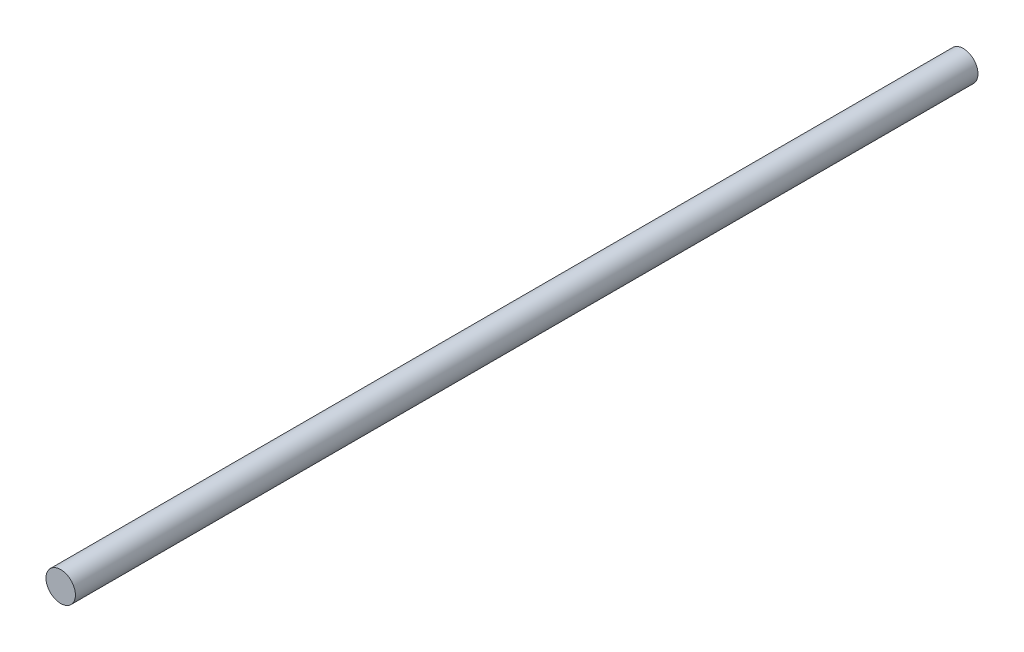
ISO-10303-21;
HEADER;
FILE_DESCRIPTION(('STEP AP214'),'2;1');
FILE_NAME('part.step','',(''),(''),'','','');
FILE_SCHEMA(('AUTOMOTIVE_DESIGN { 1 0 10303 214 1 1 1 1 }'));
ENDSEC;
DATA;
#1=APPLICATION_CONTEXT('core data for automotive mechanical design processes');
#2=APPLICATION_PROTOCOL_DEFINITION('international standard','automotive_design',2000,#1);
#3=PRODUCT_CONTEXT('',#1,'mechanical');
#4=PRODUCT('Part','Part','',(#3));
#5=PRODUCT_RELATED_PRODUCT_CATEGORY('part','',(#4));
#6=PRODUCT_DEFINITION_FORMATION('','',#4);
#7=PRODUCT_DEFINITION_CONTEXT('part definition',#1,'design');
#8=PRODUCT_DEFINITION('design','',#6,#7);
#9=PRODUCT_DEFINITION_SHAPE('','',#8);
#10=(LENGTH_UNIT() NAMED_UNIT(*) SI_UNIT(.MILLI.,.METRE.));
#11=(NAMED_UNIT(*) PLANE_ANGLE_UNIT() SI_UNIT($,.RADIAN.));
#12=(NAMED_UNIT(*) SI_UNIT($,.STERADIAN.) SOLID_ANGLE_UNIT());
#13=UNCERTAINTY_MEASURE_WITH_UNIT(LENGTH_MEASURE(1.E-05),#10,'distance_accuracy_value','');
#14=(GEOMETRIC_REPRESENTATION_CONTEXT(3) GLOBAL_UNCERTAINTY_ASSIGNED_CONTEXT((#13)) GLOBAL_UNIT_ASSIGNED_CONTEXT((#10,
#11,#12)) REPRESENTATION_CONTEXT('',''));
#15=CARTESIAN_POINT('',(0.,0.,0.));
#16=DIRECTION('',(0.,0.,1.));
#17=DIRECTION('',(1.,0.,0.));
#18=AXIS2_PLACEMENT_3D('',#15,#16,#17);
#19=CARTESIAN_POINT('',(0.,0.,171.73));
#20=DIRECTION('',(0.,0.,-1.));
#21=DIRECTION('',(-1.,0.,0.));
#22=AXIS2_PLACEMENT_3D('',#19,#20,#21);
#23=CYLINDRICAL_SURFACE('',#22,2.8);
#24=CARTESIAN_POINT('',(0.,0.,171.73));
#25=DIRECTION('',(0.,0.,1.));
#26=DIRECTION('',(1.,0.,0.));
#27=AXIS2_PLACEMENT_3D('',#24,#25,#26);
#28=CIRCLE('',#27,2.8);
#29=CARTESIAN_POINT('',(2.8,0.,171.73));
#30=VERTEX_POINT('',#29);
#31=EDGE_CURVE('E10',#30,#30,#28,.T.);
#32=ORIENTED_EDGE('',*,*,#31,.F.);
#33=EDGE_LOOP('',(#32));
#34=FACE_BOUND('',#33,.T.);
#35=CARTESIAN_POINT('',(0.,0.,0.));
#36=DIRECTION('',(0.,0.,1.));
#37=DIRECTION('',(1.,0.,0.));
#38=AXIS2_PLACEMENT_3D('',#35,#36,#37);
#39=CIRCLE('',#38,2.8);
#40=CARTESIAN_POINT('',(2.8,0.,0.));
#41=VERTEX_POINT('',#40);
#42=EDGE_CURVE('E33',#41,#41,#39,.T.);
#43=ORIENTED_EDGE('',*,*,#42,.T.);
#44=EDGE_LOOP('',(#43));
#45=FACE_BOUND('',#44,.T.);
#46=ADVANCED_FACE('F30',(#34,#45),#23,.T.);
#47=CARTESIAN_POINT('',(0.,0.,171.73));
#48=DIRECTION('',(0.,0.,1.));
#49=DIRECTION('',(1.,0.,0.));
#50=AXIS2_PLACEMENT_3D('',#47,#48,#49);
#51=PLANE('',#50);
#52=ORIENTED_EDGE('',*,*,#31,.T.);
#53=EDGE_LOOP('',(#52));
#54=FACE_BOUND('',#53,.T.);
#55=ADVANCED_FACE('F45',(#54),#51,.T.);
#56=CARTESIAN_POINT('',(0.,0.,0.));
#57=DIRECTION('',(0.,0.,1.));
#58=DIRECTION('',(1.,0.,0.));
#59=AXIS2_PLACEMENT_3D('',#56,#57,#58);
#60=PLANE('',#59);
#61=ORIENTED_EDGE('',*,*,#42,.F.);
#62=EDGE_LOOP('',(#61));
#63=FACE_BOUND('',#62,.T.);
#64=ADVANCED_FACE('F43',(#63),#60,.F.);
#65=CLOSED_SHELL('',(#46,#55,#64));
#66=MANIFOLD_SOLID_BREP('B2',#65);
#67=ADVANCED_BREP_SHAPE_REPRESENTATION('',(#18,#66),#14);
#68=SHAPE_DEFINITION_REPRESENTATION(#9,#67);
ENDSEC;
END-ISO-10303-21;
